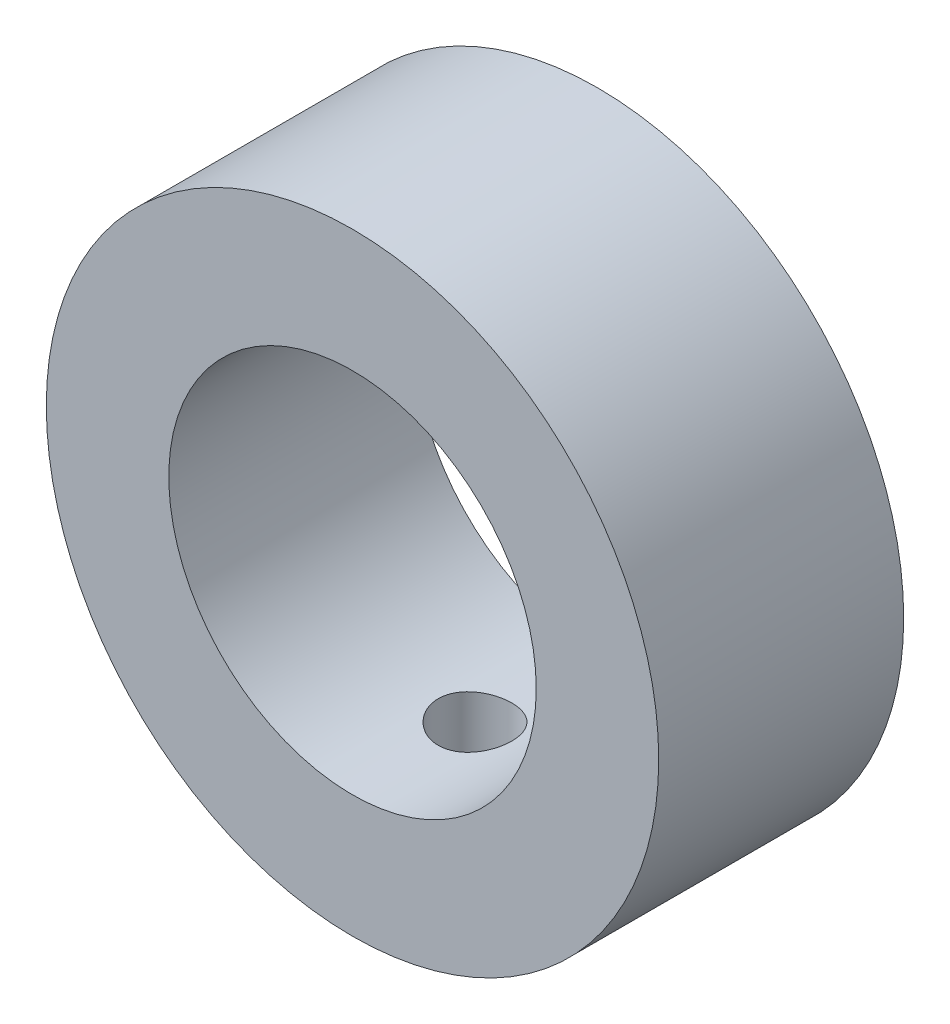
from build123d import *

# Parameters (mm, degrees)
SKIZZE1_R                    = 25
LINEAR_AUSTRAGEN1_DEPTH      = 10
LINEAR_AUSTRAGEN2_REACH      = 42.62
SKIZZE2_R                    = 15
LINEAR_AUSTRAGEN3_REACH      = 38.742
LINEAR_AUSTRAGEN3_END_RADIUS = 25
SKIZZE4_R                    = 3


with BuildPart() as part:
    # Skizze1 → Linear austragen1 (new, symmetric)
    with BuildSketch(Plane.XY):
        Circle(SKIZZE1_R)
    extrude(amount=LINEAR_AUSTRAGEN1_DEPTH, both=True)

    # Skizze2 → Linear austragen2 (cut, up to next)
    with BuildSketch(Plane.XY.offset(10), mode=Mode.PRIVATE) as linear_austragen2_sk1:
        Circle(SKIZZE2_R)
    linear_austragen2_tool1 = extrude(linear_austragen2_sk1.sketch, amount=-LINEAR_AUSTRAGEN2_REACH, mode=Mode.PRIVATE) & part.part
    add(linear_austragen2_tool1.solids().sort_by_distance((0, 0, 10))[0], mode=Mode.SUBTRACT)

    # Linear austragen3: up to this cylinder (the profile starts inside it)
    linear_austragen3_end = Plane(origin=(0, 0, 0), z_dir=(0, 0, -1)) * Cylinder(LINEAR_AUSTRAGEN3_END_RADIUS, 128.484, mode=Mode.PRIVATE)
    # Skizze4 → Linear austragen3 (cut, up to the surface)
    with BuildSketch(Plane(origin=(0, 0, 0), x_dir=(1, 0, 0), z_dir=(0, 1, 0)), mode=Mode.PRIVATE) as linear_austragen3_sk1:
        with Locations(Location((0, 0, 0), (0, 0, 270))):
            Circle(SKIZZE4_R)
    linear_austragen3_tool1 = extrude(linear_austragen3_sk1.sketch, amount=-LINEAR_AUSTRAGEN3_REACH, mode=Mode.PRIVATE) & linear_austragen3_end
    add(linear_austragen3_tool1.solids().sort_by_distance((0, 0, 0))[0], mode=Mode.SUBTRACT)


solid = part.part
